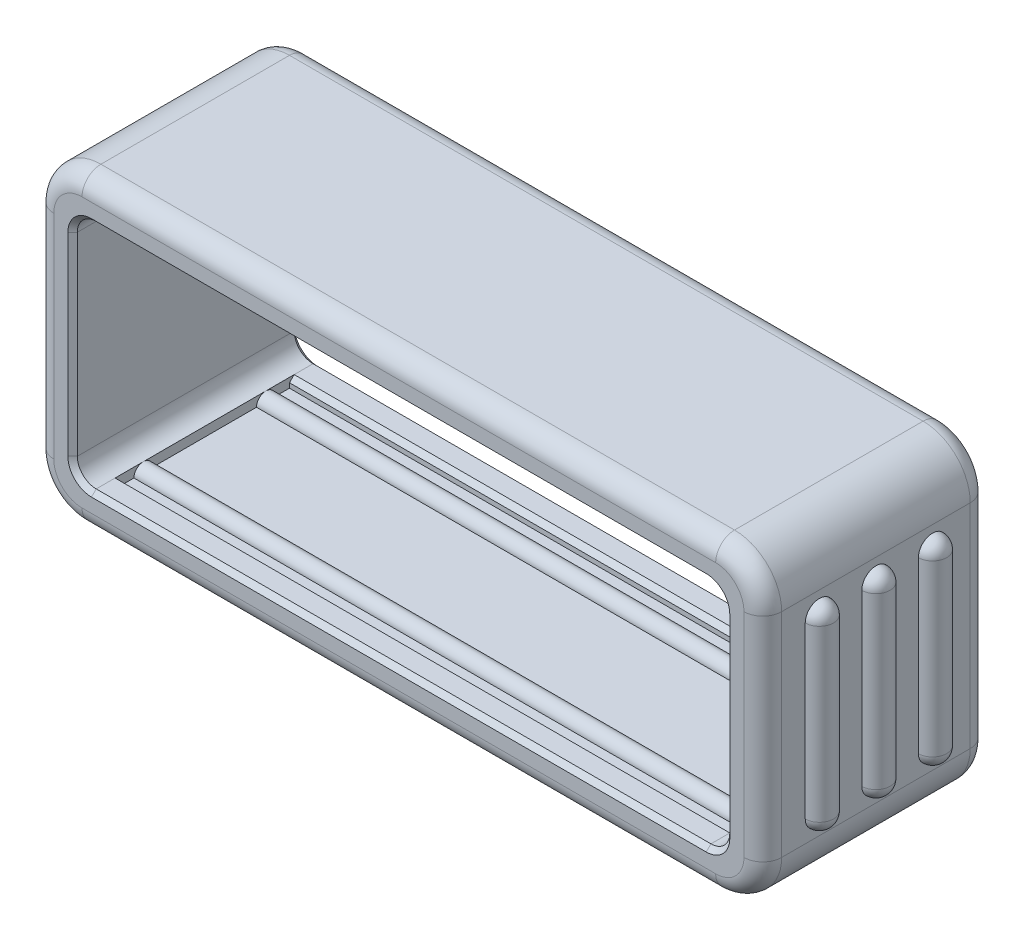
from build123d import *

# Parameters (mm, degrees)
SKETCH1_W               = 19.608999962
SKETCH1_H               = 8.273800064
SKETCH1_W_2             = 17.576999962
SKETCH1_H_2             = 6.241800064
BOSS_EXTRUDE1_DEPTH     = 6.096
FILLET1_R               = 0.508
FILLET2_R               = 1.27
FILLET3_R               = 0.508
SKETCH2_R               = 0.381
BOSS_EXTRUDE2_DEPTH     = 2.286
LPATTERN1_COUNT         = 3
LPATTERN1_PITCH         = 1.524
MIRROR1_COPY_1_SKETCH_R = 0.381
MIRROR1_COPY_1_DEPTH    = 2.286
MIRROR1_COPY_2_SKETCH_R = 0.381
MIRROR1_COPY_2_DEPTH    = 2.286
CHAMFER1_SIZE           = 0.127
CUT_EXTRUDE1_START      = -0.762
SKETCH5_W               = 16.560999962
SKETCH5_H               = 6.749800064
CUT_EXTRUDE1_DEPTH      = 4.572
BOSS_EXTRUDE3_REACH     = 21.881
SKETCH6_R               = 0.254
CHAMFER2_SIZE           = 0.127


with BuildPart() as part:
    # Sketch1 → Boss-Extrude1 (new body)
    with BuildSketch(Plane.XY):
        Rectangle(SKETCH1_W, SKETCH1_H)
        Rectangle(SKETCH1_W_2, SKETCH1_H_2, mode=Mode.SUBTRACT)
    extrude(amount=BOSS_EXTRUDE1_DEPTH)

    # Fillet1
    fillet1_edges = [part.edges().sort_by_distance(p)[0] for p in [
        (-8.788499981, 3.120900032, 3.048),
        (-8.788499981, -3.120900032, 3.048),
        (8.788499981, -3.120900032, 3.048),
        (8.788499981, 3.120900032, 3.048),
    ]]
    fillet(fillet1_edges, radius=FILLET1_R)

    # Fillet2
    fillet2_edges = [part.edges().sort_by_distance(p)[0] for p in [
        (-9.804499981, 4.136900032, 3.048),
        (9.804499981, 4.136900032, 3.048),
        (9.804499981, -4.136900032, 3.048),
        (-9.804499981, -4.136900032, 3.048),
    ]]
    fillet(fillet2_edges, radius=FILLET2_R)

    # Fillet3
    fillet3_edges = [part.edges().sort_by_distance(p)[0] for p in [
        (0, -4.136900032, 0),
        (0, -4.136900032, 6.096),
        (-9.804499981, 0, 0),
        (0, 4.136900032, 0),
        (9.804499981, 0, 0),
        (9.432525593, -3.764925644, 0),
        (9.432525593, 3.764925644, 0),
        (-9.432525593, 3.764925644, 0),
        (-9.432525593, -3.764925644, 0),
        (-9.804499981, 0, 6.096),
        (9.804499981, 0, 6.096),
        (0, 4.136900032, 6.096),
        (9.432525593, -3.764925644, 6.096),
        (9.432525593, 3.764925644, 6.096),
        (-9.432525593, 3.764925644, 6.096),
        (-9.432525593, -3.764925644, 6.096),
    ]]
    fillet(fillet3_edges, radius=FILLET3_R)

    # Sketch2 → Boss-Extrude2 (add, symmetric)
    with BuildSketch(Plane(origin=(0, 0, 0), x_dir=(1, 0, 0), z_dir=(0, 1, 0))):
        with Locations((-9.804499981, -1.524)):
            Circle(SKETCH2_R)
    boss_extrude2 = extrude(amount=BOSS_EXTRUDE2_DEPTH, both=True)

    # Sketch3 → Revolve1 (revolve)
    with BuildSketch(Plane(origin=(0, 2.286, 0), x_dir=(1, 0, 0), z_dir=(0, 1, 0))):
        with BuildLine():
            Line((-9.804499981, -1.905), (-9.804499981, -1.143))
            ThreePointArc((-9.804499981, -1.143), (-10.185499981, -1.524), (-9.804499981, -1.905))
        make_face()
    revolve1 = revolve(axis=Axis((-9.804499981, 2.286, 1.905), (0, 0, -1)))

    # Sketch4 → Revolve2 (revolve)
    with BuildSketch(Plane.XZ.offset(2.286)):
        with BuildLine():
            Line((-9.804499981, 1.143), (-9.804499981, 1.905))
            ThreePointArc((-9.804499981, 1.905), (-10.185499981, 1.524), (-9.804499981, 1.143))
        make_face()
    revolve2 = revolve(axis=Axis((-9.804499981, -2.286, 1.143), (0, 0, 1)))

    # LPattern1: Boss-Extrude2, Revolve1, Revolve2 ×3
    with Locations(*[(0, 0, i * LPATTERN1_PITCH) for i in range(1, LPATTERN1_COUNT)]):
        add(boss_extrude2)
        add(revolve1)
        add(revolve2)

    # Mirror1: Boss-Extrude2, Revolve1, Revolve2 across plane
    add(boss_extrude2.mirror(Plane(origin=(0, 0, 0), x_dir=(0, 0, 1), z_dir=(1, 0, 0))))
    add(revolve1.mirror(Plane(origin=(0, 0, 0), x_dir=(0, 0, 1), z_dir=(1, 0, 0))))
    add(revolve2.mirror(Plane(origin=(0, 0, 0), x_dir=(0, 0, 1), z_dir=(1, 0, 0))))

    # Mirror1 copy 1 sketch → Mirror1 copy 1 (add, symmetric)
    with BuildSketch(Plane(origin=(0, 0, 1.524), x_dir=(-1, 0, 0), z_dir=(0, 1, 0))):
        with Locations((-9.804499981, 1.524)):
            Circle(MIRROR1_COPY_1_SKETCH_R)
    extrude(amount=MIRROR1_COPY_1_DEPTH, both=True)

    # Mirror1 copy 2 sketch → Mirror1 copy 2 (add, symmetric)
    with BuildSketch(Plane(origin=(0, 0, 3.048), x_dir=(-1, 0, 0), z_dir=(0, 1, 0))):
        with Locations((-9.804499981, 1.524)):
            Circle(MIRROR1_COPY_2_SKETCH_R)
    extrude(amount=MIRROR1_COPY_2_DEPTH, both=True)

    # Mirror1 copy 3 sketch → Mirror1 copy 3 (revolve)
    with BuildSketch(Plane(origin=(0, 2.286, 1.524), x_dir=(-1, 0, 0), z_dir=(0, 1, 0))):
        with BuildLine():
            Line((-9.804499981, 1.905), (-9.804499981, 1.143))
            ThreePointArc((-9.804499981, 1.143), (-10.185499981, 1.524), (-9.804499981, 1.905))
        make_face()
    revolve(axis=Axis((9.804499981, 2.286, 3.429), (0, 0, 1)))

    # Mirror1 copy 4 sketch → Mirror1 copy 4 (revolve)
    with BuildSketch(Plane(origin=(0, 2.286, 3.048), x_dir=(-1, 0, 0), z_dir=(0, 1, 0))):
        with BuildLine():
            Line((-9.804499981, 1.905), (-9.804499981, 1.143))
            ThreePointArc((-9.804499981, 1.143), (-10.185499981, 1.524), (-9.804499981, 1.905))
        make_face()
    revolve(axis=Axis((9.804499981, 2.286, 4.953), (0, 0, 1)))

    # Mirror1 copy 5 sketch → Mirror1 copy 5 (revolve)
    with BuildSketch(Plane(origin=(0, -2.286, 1.524), x_dir=(-1, 0, 0), z_dir=(0, -1, 0))):
        with BuildLine():
            Line((-9.804499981, -1.143), (-9.804499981, -1.905))
            ThreePointArc((-9.804499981, -1.905), (-10.185499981, -1.524), (-9.804499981, -1.143))
        make_face()
    revolve(axis=Axis((9.804499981, -2.286, 2.667), (0, 0, -1)))

    # Mirror1 copy 6 sketch → Mirror1 copy 6 (revolve)
    with BuildSketch(Plane(origin=(0, -2.286, 3.048), x_dir=(-1, 0, 0), z_dir=(0, -1, 0))):
        with BuildLine():
            Line((-9.804499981, -1.143), (-9.804499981, -1.905))
            ThreePointArc((-9.804499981, -1.905), (-10.185499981, -1.524), (-9.804499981, -1.143))
        make_face()
    revolve(axis=Axis((9.804499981, -2.286, 4.191), (0, 0, -1)))

    # Chamfer1
    chamfer1_edges = [part.edges().sort_by_distance(p)[0] for p in [
        (8.788499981, 0, 0),
        (8.788499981, 0, 6.096),
        (0, 3.120900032, 0),
        (0, 3.120900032, 6.096),
        (0, -3.120900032, 0),
        (0, -3.120900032, 6.096),
        (-8.788499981, 0, 0),
        (-8.788499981, 0, 6.096),
        (8.639710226, 2.972110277, 0),
        (8.639710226, 2.972110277, 6.096),
        (8.639710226, -2.972110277, 0),
        (8.639710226, -2.972110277, 6.096),
        (-8.639710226, -2.972110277, 0),
        (-8.639710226, -2.972110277, 6.096),
        (-8.639710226, 2.972110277, 0),
        (-8.639710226, 2.972110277, 6.096),
    ]]
    chamfer(chamfer1_edges, length=CHAMFER1_SIZE)

    # Sketch5 → Cut-Extrude1 (cut)
    with BuildSketch(Plane(origin=(0, 0, 0), x_dir=(-1, 0, 0), z_dir=(0, 0, -1)).offset(CUT_EXTRUDE1_START)):
        Rectangle(SKETCH5_W, SKETCH5_H)
    extrude(amount=-CUT_EXTRUDE1_DEPTH, mode=Mode.SUBTRACT)

    # Sketch6 → Boss-Extrude3 (add, up to next)
    with BuildSketch(Plane.ZY.offset(-8.280499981), mode=Mode.PRIVATE) as boss_extrude3_sk1:
        with Locations((1.397, 3.374900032)):
            Circle(SKETCH6_R)
    boss_extrude3_tool1 = extrude(boss_extrude3_sk1.sketch, amount=BOSS_EXTRUDE3_REACH, mode=Mode.PRIVATE) - part.part
    # Sketch6 → Boss-Extrude3 (add, up to next)
    with BuildSketch(Plane.ZY.offset(-8.280499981), mode=Mode.PRIVATE) as boss_extrude3_sk2:
        with Locations((4.699, 3.374900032)):
            Circle(SKETCH6_R)
    boss_extrude3_tool2 = extrude(boss_extrude3_sk2.sketch, amount=BOSS_EXTRUDE3_REACH, mode=Mode.PRIVATE) - part.part
    # Sketch6 → Boss-Extrude3 (add, up to next)
    with BuildSketch(Plane.ZY.offset(-8.280499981), mode=Mode.PRIVATE) as boss_extrude3_sk3:
        with Locations((1.397, -3.374900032)):
            Circle(SKETCH6_R)
    boss_extrude3_tool3 = extrude(boss_extrude3_sk3.sketch, amount=BOSS_EXTRUDE3_REACH, mode=Mode.PRIVATE) - part.part
    # Sketch6 → Boss-Extrude3 (add, up to next)
    with BuildSketch(Plane.ZY.offset(-8.280499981), mode=Mode.PRIVATE) as boss_extrude3_sk4:
        with Locations((4.699, -3.374900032)):
            Circle(SKETCH6_R)
    boss_extrude3_tool4 = extrude(boss_extrude3_sk4.sketch, amount=BOSS_EXTRUDE3_REACH, mode=Mode.PRIVATE) - part.part
    add(boss_extrude3_tool1.solids().sort_by_distance((8.2805, 3.3749, 1.397))[0])
    add(boss_extrude3_tool2.solids().sort_by_distance((8.2805, 3.3749, 4.699))[0])
    add(boss_extrude3_tool3.solids().sort_by_distance((8.2805, -3.3749, 1.397))[0])
    add(boss_extrude3_tool4.solids().sort_by_distance((8.2805, -3.3749, 4.699))[0])

    # Chamfer2
    chamfer2_edges = [part.edges().sort_by_distance(p)[0] for p in [
        (0, -3.120900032, 5.334),
        (0, 3.120900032, 5.334),
        (0, -3.120900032, 0.762),
        (0, 3.120900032, 0.762),
    ]]
    chamfer(chamfer2_edges, length=CHAMFER2_SIZE)


solid = part.part
